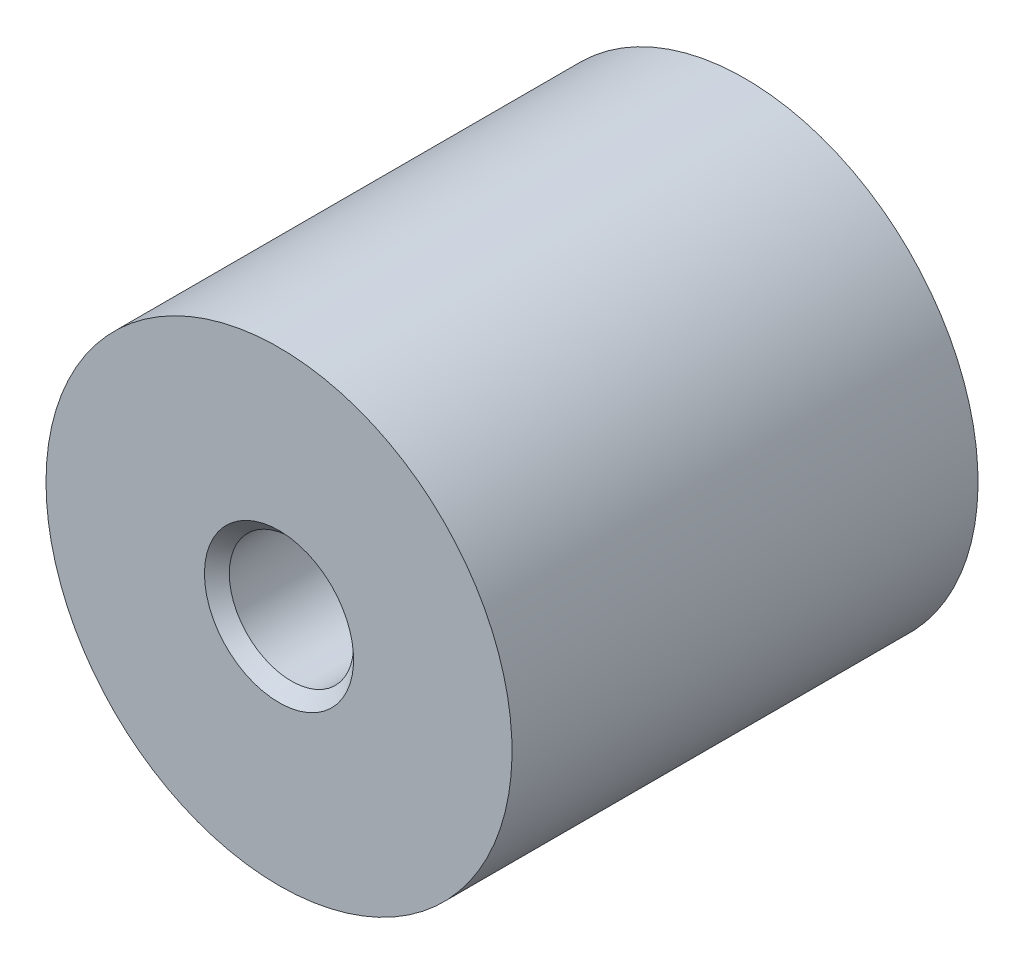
ISO-10303-21;
HEADER;
FILE_DESCRIPTION(('STEP AP214'),'2;1');
FILE_NAME('part.step','',(''),(''),'','','');
FILE_SCHEMA(('AUTOMOTIVE_DESIGN { 1 0 10303 214 1 1 1 1 }'));
ENDSEC;
DATA;
#1=APPLICATION_CONTEXT('core data for automotive mechanical design processes');
#2=APPLICATION_PROTOCOL_DEFINITION('international standard','automotive_design',2000,#1);
#3=PRODUCT_CONTEXT('',#1,'mechanical');
#4=PRODUCT('Part','Part','',(#3));
#5=PRODUCT_RELATED_PRODUCT_CATEGORY('part','',(#4));
#6=PRODUCT_DEFINITION_FORMATION('','',#4);
#7=PRODUCT_DEFINITION_CONTEXT('part definition',#1,'design');
#8=PRODUCT_DEFINITION('design','',#6,#7);
#9=PRODUCT_DEFINITION_SHAPE('','',#8);
#10=(LENGTH_UNIT() NAMED_UNIT(*) SI_UNIT(.MILLI.,.METRE.));
#11=(NAMED_UNIT(*) PLANE_ANGLE_UNIT() SI_UNIT($,.RADIAN.));
#12=(NAMED_UNIT(*) SI_UNIT($,.STERADIAN.) SOLID_ANGLE_UNIT());
#13=UNCERTAINTY_MEASURE_WITH_UNIT(LENGTH_MEASURE(1.E-05),#10,'distance_accuracy_value','');
#14=(GEOMETRIC_REPRESENTATION_CONTEXT(3) GLOBAL_UNCERTAINTY_ASSIGNED_CONTEXT((#13)) GLOBAL_UNIT_ASSIGNED_CONTEXT((#10,
#11,#12)) REPRESENTATION_CONTEXT('',''));
#15=CARTESIAN_POINT('',(0.,0.,0.));
#16=DIRECTION('',(0.,0.,1.));
#17=DIRECTION('',(1.,0.,0.));
#18=AXIS2_PLACEMENT_3D('',#15,#16,#17);
#19=CARTESIAN_POINT('',(0.,0.,0.33333333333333));
#20=DIRECTION('',(0.,0.,1.));
#21=DIRECTION('',(0.,-1.,0.));
#22=AXIS2_PLACEMENT_3D('',#19,#20,#21);
#23=CYLINDRICAL_SURFACE('',#22,7.5);
#24=CARTESIAN_POINT('',(0.,0.,0.));
#25=DIRECTION('',(0.,0.,1.));
#26=DIRECTION('',(0.,-1.,0.));
#27=AXIS2_PLACEMENT_3D('',#24,#25,#26);
#28=CIRCLE('',#27,7.5);
#29=CARTESIAN_POINT('',(0.,-7.5,0.));
#30=VERTEX_POINT('',#29);
#31=EDGE_CURVE('E23',#30,#30,#28,.T.);
#32=ORIENTED_EDGE('',*,*,#31,.T.);
#33=EDGE_LOOP('',(#32));
#34=FACE_BOUND('',#33,.T.);
#35=CARTESIAN_POINT('',(0.,0.,15.));
#36=DIRECTION('',(0.,0.,-1.));
#37=DIRECTION('',(-1.,0.,0.));
#38=AXIS2_PLACEMENT_3D('',#35,#36,#37);
#39=CIRCLE('',#38,7.5);
#40=CARTESIAN_POINT('',(-7.5,0.,15.));
#41=VERTEX_POINT('',#40);
#42=EDGE_CURVE('E32',#41,#41,#39,.T.);
#43=ORIENTED_EDGE('',*,*,#42,.T.);
#44=EDGE_LOOP('',(#43));
#45=FACE_BOUND('',#44,.T.);
#46=ADVANCED_FACE('F12',(#34,#45),#23,.T.);
#47=CARTESIAN_POINT('',(7.5,0.,0.));
#48=DIRECTION('',(0.,0.,-1.));
#49=DIRECTION('',(0.,1.,0.));
#50=AXIS2_PLACEMENT_3D('',#47,#48,#49);
#51=PLANE('',#50);
#52=CARTESIAN_POINT('',(0.,0.,0.));
#53=DIRECTION('',(0.,0.,-1.));
#54=DIRECTION('',(0.,1.,0.));
#55=AXIS2_PLACEMENT_3D('',#52,#53,#54);
#56=CIRCLE('',#55,2.4);
#57=CARTESIAN_POINT('',(0.,2.4,0.));
#58=VERTEX_POINT('',#57);
#59=EDGE_CURVE('E8',#58,#58,#56,.F.);
#60=ORIENTED_EDGE('',*,*,#59,.T.);
#61=EDGE_LOOP('',(#60));
#62=FACE_BOUND('',#61,.T.);
#63=ORIENTED_EDGE('',*,*,#31,.F.);
#64=EDGE_LOOP('',(#63));
#65=FACE_BOUND('',#64,.T.);
#66=ADVANCED_FACE('F58',(#62,#65),#51,.T.);
#67=CARTESIAN_POINT('',(0.,0.,0.));
#68=DIRECTION('',(0.,0.,1.));
#69=DIRECTION('',(0.,-1.,0.));
#70=AXIS2_PLACEMENT_3D('',#67,#68,#69);
#71=CYLINDRICAL_SURFACE('',#70,2.);
#72=CARTESIAN_POINT('',(0.,0.,0.399999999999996));
#73=DIRECTION('',(0.,0.,-1.));
#74=DIRECTION('',(0.,1.,0.));
#75=AXIS2_PLACEMENT_3D('',#72,#73,#74);
#76=CIRCLE('',#75,2.);
#77=CARTESIAN_POINT('',(0.,2.,0.399999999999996));
#78=VERTEX_POINT('',#77);
#79=EDGE_CURVE('E19',#78,#78,#76,.T.);
#80=ORIENTED_EDGE('',*,*,#79,.T.);
#81=EDGE_LOOP('',(#80));
#82=FACE_BOUND('',#81,.T.);
#83=CARTESIAN_POINT('',(0.,0.,4.));
#84=DIRECTION('',(0.,0.,-1.));
#85=DIRECTION('',(0.,1.,0.));
#86=AXIS2_PLACEMENT_3D('',#83,#84,#85);
#87=CIRCLE('',#86,2.);
#88=CARTESIAN_POINT('',(0.,2.,4.));
#89=VERTEX_POINT('',#88);
#90=EDGE_CURVE('E27',#89,#89,#87,.T.);
#91=ORIENTED_EDGE('',*,*,#90,.F.);
#92=EDGE_LOOP('',(#91));
#93=FACE_BOUND('',#92,.T.);
#94=ADVANCED_FACE('F63',(#82,#93),#71,.F.);
#95=CARTESIAN_POINT('',(0.,0.,4.));
#96=DIRECTION('',(0.,0.,-1.));
#97=DIRECTION('',(0.,1.,0.));
#98=AXIS2_PLACEMENT_3D('',#95,#96,#97);
#99=PLANE('',#98);
#100=ORIENTED_EDGE('',*,*,#90,.T.);
#101=EDGE_LOOP('',(#100));
#102=FACE_BOUND('',#101,.T.);
#103=ADVANCED_FACE('F69',(#102),#99,.T.);
#104=CARTESIAN_POINT('',(0.,0.,0.399999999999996));
#105=DIRECTION('',(0.,0.,-1.));
#106=DIRECTION('',(0.,1.,0.));
#107=AXIS2_PLACEMENT_3D('',#104,#105,#106);
#108=CONICAL_SURFACE('',#107,2.,0.785398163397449);
#109=ORIENTED_EDGE('',*,*,#59,.F.);
#110=EDGE_LOOP('',(#109));
#111=FACE_BOUND('',#110,.T.);
#112=ORIENTED_EDGE('',*,*,#79,.F.);
#113=EDGE_LOOP('',(#112));
#114=FACE_BOUND('',#113,.T.);
#115=ADVANCED_FACE('F14',(#111,#114),#108,.F.);
#116=CARTESIAN_POINT('',(0.,7.5,15.));
#117=DIRECTION('',(0.,0.,1.));
#118=DIRECTION('',(1.,0.,0.));
#119=AXIS2_PLACEMENT_3D('',#116,#117,#118);
#120=PLANE('',#119);
#121=CARTESIAN_POINT('',(0.,0.,15.));
#122=DIRECTION('',(0.,0.,-1.));
#123=DIRECTION('',(-1.,0.,0.));
#124=AXIS2_PLACEMENT_3D('',#121,#122,#123);
#125=CIRCLE('',#124,2.4);
#126=CARTESIAN_POINT('',(-2.4,0.,15.));
#127=VERTEX_POINT('',#126);
#128=EDGE_CURVE('E35',#127,#127,#125,.T.);
#129=ORIENTED_EDGE('',*,*,#128,.T.);
#130=EDGE_LOOP('',(#129));
#131=FACE_BOUND('',#130,.T.);
#132=ORIENTED_EDGE('',*,*,#42,.F.);
#133=EDGE_LOOP('',(#132));
#134=FACE_BOUND('',#133,.T.);
#135=ADVANCED_FACE('F73',(#131,#134),#120,.T.);
#136=CARTESIAN_POINT('',(0.,0.,15.));
#137=DIRECTION('',(0.,0.,1.));
#138=DIRECTION('',(1.,0.,0.));
#139=AXIS2_PLACEMENT_3D('',#136,#137,#138);
#140=CONICAL_SURFACE('',#139,2.4,0.785398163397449);
#141=CARTESIAN_POINT('',(0.,0.,14.6));
#142=DIRECTION('',(0.,0.,-1.));
#143=DIRECTION('',(-1.,0.,0.));
#144=AXIS2_PLACEMENT_3D('',#141,#142,#143);
#145=CIRCLE('',#144,2.);
#146=CARTESIAN_POINT('',(-2.,0.,14.6));
#147=VERTEX_POINT('',#146);
#148=EDGE_CURVE('E38',#147,#147,#145,.T.);
#149=ORIENTED_EDGE('',*,*,#148,.T.);
#150=EDGE_LOOP('',(#149));
#151=FACE_BOUND('',#150,.T.);
#152=ORIENTED_EDGE('',*,*,#128,.F.);
#153=EDGE_LOOP('',(#152));
#154=FACE_BOUND('',#153,.T.);
#155=ADVANCED_FACE('F55',(#151,#154),#140,.F.);
#156=CARTESIAN_POINT('',(0.,0.,0.));
#157=DIRECTION('',(0.,0.,-1.));
#158=DIRECTION('',(-1.,0.,0.));
#159=AXIS2_PLACEMENT_3D('',#156,#157,#158);
#160=CYLINDRICAL_SURFACE('',#159,2.);
#161=CARTESIAN_POINT('',(0.,0.,11.));
#162=DIRECTION('',(0.,0.,-1.));
#163=DIRECTION('',(-1.,0.,0.));
#164=AXIS2_PLACEMENT_3D('',#161,#162,#163);
#165=CIRCLE('',#164,2.);
#166=CARTESIAN_POINT('',(-2.,0.,11.));
#167=VERTEX_POINT('',#166);
#168=EDGE_CURVE('E41',#167,#167,#165,.T.);
#169=ORIENTED_EDGE('',*,*,#168,.T.);
#170=EDGE_LOOP('',(#169));
#171=FACE_BOUND('',#170,.T.);
#172=ORIENTED_EDGE('',*,*,#148,.F.);
#173=EDGE_LOOP('',(#172));
#174=FACE_BOUND('',#173,.T.);
#175=ADVANCED_FACE('F45',(#171,#174),#160,.F.);
#176=CARTESIAN_POINT('',(0.,2.,11.));
#177=DIRECTION('',(0.,0.,1.));
#178=DIRECTION('',(1.,0.,0.));
#179=AXIS2_PLACEMENT_3D('',#176,#177,#178);
#180=PLANE('',#179);
#181=ORIENTED_EDGE('',*,*,#168,.F.);
#182=EDGE_LOOP('',(#181));
#183=FACE_BOUND('',#182,.T.);
#184=ADVANCED_FACE('F48',(#183),#180,.T.);
#185=CLOSED_SHELL('',(#46,#66,#94,#103,#115,#135,#155,#175,#184));
#186=MANIFOLD_SOLID_BREP('B1',#185);
#187=ADVANCED_BREP_SHAPE_REPRESENTATION('',(#18,#186),#14);
#188=SHAPE_DEFINITION_REPRESENTATION(#9,#187);
ENDSEC;
END-ISO-10303-21;
